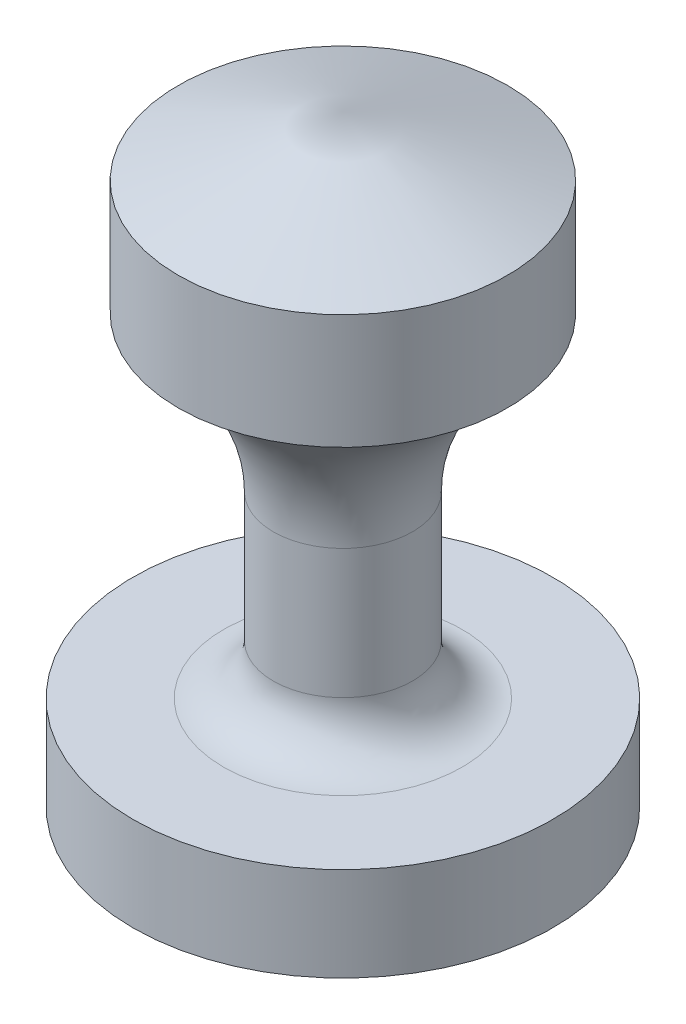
from build123d import *


with BuildPart() as part:
    # Sketch1 → Revolve1 (revolve)
    with BuildSketch(Plane.XY, mode=Mode.PRIVATE) as revolve1_sk:
        with BuildLine():
            Line((0, 0), (33.855867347, 0))
            Line((33.855867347, 0), (33.855867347, 15.146045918))
            Line((33.855867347, 15.146045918), (19.244387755, 15.146045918))
            ThreePointArc((19.244387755, 15.146045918), (13.574455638, 17.494608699), (11.225892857, 23.164540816))
            Line((11.225892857, 23.164540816), (11.225892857, 44.012627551))
            ThreePointArc((11.225892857, 44.012627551), (15.362935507, 58.651244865), (26.550127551, 68.959056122))
            Line((26.550127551, 68.959056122), (26.550127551, 87.490688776))
            Line((26.550127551, 87.490688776), (0, 97.112882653))
            Line((0, 97.112882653), (0, 0))
        make_face()
    revolve(revolve1_sk.sketch.rotate(Axis((0, 97.112882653, 0), (0, -1, 0)), 90), axis=Axis((0, 97.112882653, 0), (0, -1, 0)))


solid = part.part
